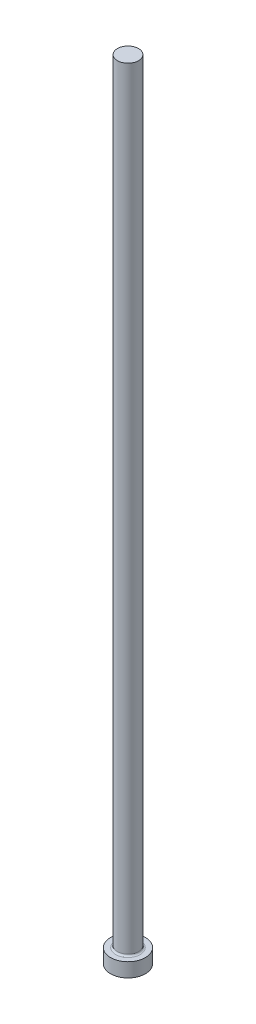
ISO-10303-21;
HEADER;
FILE_DESCRIPTION(('STEP AP214'),'2;1');
FILE_NAME('part.step','',(''),(''),'','','');
FILE_SCHEMA(('AUTOMOTIVE_DESIGN { 1 0 10303 214 1 1 1 1 }'));
ENDSEC;
DATA;
#1=APPLICATION_CONTEXT('core data for automotive mechanical design processes');
#2=APPLICATION_PROTOCOL_DEFINITION('international standard','automotive_design',2000,#1);
#3=PRODUCT_CONTEXT('',#1,'mechanical');
#4=PRODUCT('Part','Part','',(#3));
#5=PRODUCT_RELATED_PRODUCT_CATEGORY('part','',(#4));
#6=PRODUCT_DEFINITION_FORMATION('','',#4);
#7=PRODUCT_DEFINITION_CONTEXT('part definition',#1,'design');
#8=PRODUCT_DEFINITION('design','',#6,#7);
#9=PRODUCT_DEFINITION_SHAPE('','',#8);
#10=(LENGTH_UNIT() NAMED_UNIT(*) SI_UNIT(.MILLI.,.METRE.));
#11=(NAMED_UNIT(*) PLANE_ANGLE_UNIT() SI_UNIT($,.RADIAN.));
#12=(NAMED_UNIT(*) SI_UNIT($,.STERADIAN.) SOLID_ANGLE_UNIT());
#13=UNCERTAINTY_MEASURE_WITH_UNIT(LENGTH_MEASURE(1.E-05),#10,'distance_accuracy_value','');
#14=(GEOMETRIC_REPRESENTATION_CONTEXT(3) GLOBAL_UNCERTAINTY_ASSIGNED_CONTEXT((#13)) GLOBAL_UNIT_ASSIGNED_CONTEXT((#10,
#11,#12)) REPRESENTATION_CONTEXT('',''));
#15=CARTESIAN_POINT('',(0.,0.,0.));
#16=DIRECTION('',(0.,0.,1.));
#17=DIRECTION('',(1.,0.,0.));
#18=AXIS2_PLACEMENT_3D('',#15,#16,#17);
#19=CARTESIAN_POINT('',(4.76249999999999,355.6,0.));
#20=DIRECTION('',(0.,-1.,0.));
#21=DIRECTION('',(1.,0.,0.));
#22=AXIS2_PLACEMENT_3D('',#19,#20,#21);
#23=PLANE('',#22);
#24=CARTESIAN_POINT('',(0.,355.6,0.));
#25=DIRECTION('',(0.,1.,0.));
#26=DIRECTION('',(-1.,0.,0.));
#27=AXIS2_PLACEMENT_3D('',#24,#25,#26);
#28=CIRCLE('',#27,4.7625);
#29=CARTESIAN_POINT('',(-4.76250000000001,355.6,0.));
#30=VERTEX_POINT('',#29);
#31=EDGE_CURVE('E10',#30,#30,#28,.T.);
#32=ORIENTED_EDGE('',*,*,#31,.T.);
#33=EDGE_LOOP('',(#32));
#34=FACE_BOUND('',#33,.T.);
#35=ADVANCED_FACE('F30',(#34),#23,.F.);
#36=CARTESIAN_POINT('',(0.,355.6,0.));
#37=DIRECTION('',(0.,1.,0.));
#38=DIRECTION('',(-1.,0.,0.));
#39=AXIS2_PLACEMENT_3D('',#36,#37,#38);
#40=CYLINDRICAL_SURFACE('',#39,4.7625);
#41=ORIENTED_EDGE('',*,*,#31,.F.);
#42=EDGE_LOOP('',(#41));
#43=FACE_BOUND('',#42,.T.);
#44=CARTESIAN_POINT('',(0.,7.11200000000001,0.));
#45=DIRECTION('',(0.,1.,0.));
#46=DIRECTION('',(-1.,0.,0.));
#47=AXIS2_PLACEMENT_3D('',#44,#45,#46);
#48=CIRCLE('',#47,4.7625);
#49=CARTESIAN_POINT('',(-4.7625,7.11200000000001,0.));
#50=VERTEX_POINT('',#49);
#51=EDGE_CURVE('E36',#50,#50,#48,.T.);
#52=ORIENTED_EDGE('',*,*,#51,.T.);
#53=EDGE_LOOP('',(#52));
#54=FACE_BOUND('',#53,.T.);
#55=ADVANCED_FACE('F65',(#43,#54),#40,.T.);
#56=CARTESIAN_POINT('',(0.,7.112,0.));
#57=DIRECTION('',(0.,1.,0.));
#58=DIRECTION('',(-1.,0.,0.));
#59=AXIS2_PLACEMENT_3D('',#56,#57,#58);
#60=TOROIDAL_SURFACE('',#59,5.5245,0.762);
#61=ORIENTED_EDGE('',*,*,#51,.F.);
#62=EDGE_LOOP('',(#61));
#63=FACE_BOUND('',#62,.T.);
#64=CARTESIAN_POINT('',(0.,6.35000000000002,0.));
#65=DIRECTION('',(0.,1.,0.));
#66=DIRECTION('',(-1.,0.,0.));
#67=AXIS2_PLACEMENT_3D('',#64,#65,#66);
#68=CIRCLE('',#67,5.5245);
#69=CARTESIAN_POINT('',(-5.5245,6.35000000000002,0.));
#70=VERTEX_POINT('',#69);
#71=EDGE_CURVE('E40',#70,#70,#68,.T.);
#72=ORIENTED_EDGE('',*,*,#71,.T.);
#73=EDGE_LOOP('',(#72));
#74=FACE_BOUND('',#73,.T.);
#75=ADVANCED_FACE('F69',(#63,#74),#60,.F.);
#76=CARTESIAN_POINT('',(7.874,6.35,0.));
#77=DIRECTION('',(0.,-1.,0.));
#78=DIRECTION('',(1.,0.,0.));
#79=AXIS2_PLACEMENT_3D('',#76,#77,#78);
#80=PLANE('',#79);
#81=ORIENTED_EDGE('',*,*,#71,.F.);
#82=EDGE_LOOP('',(#81));
#83=FACE_BOUND('',#82,.T.);
#84=CARTESIAN_POINT('',(0.,6.35000000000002,0.));
#85=DIRECTION('',(0.,1.,0.));
#86=DIRECTION('',(-1.,0.,0.));
#87=AXIS2_PLACEMENT_3D('',#84,#85,#86);
#88=CIRCLE('',#87,7.874);
#89=CARTESIAN_POINT('',(-7.874,6.35000000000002,0.));
#90=VERTEX_POINT('',#89);
#91=EDGE_CURVE('E44',#90,#90,#88,.T.);
#92=ORIENTED_EDGE('',*,*,#91,.T.);
#93=EDGE_LOOP('',(#92));
#94=FACE_BOUND('',#93,.T.);
#95=ADVANCED_FACE('F61',(#83,#94),#80,.F.);
#96=CARTESIAN_POINT('',(0.,355.6,0.));
#97=DIRECTION('',(0.,1.,0.));
#98=DIRECTION('',(-1.,0.,0.));
#99=AXIS2_PLACEMENT_3D('',#96,#97,#98);
#100=CYLINDRICAL_SURFACE('',#99,7.874);
#101=ORIENTED_EDGE('',*,*,#91,.F.);
#102=EDGE_LOOP('',(#101));
#103=FACE_BOUND('',#102,.T.);
#104=CARTESIAN_POINT('',(0.,0.,0.));
#105=DIRECTION('',(0.,1.,0.));
#106=DIRECTION('',(-1.,0.,0.));
#107=AXIS2_PLACEMENT_3D('',#104,#105,#106);
#108=CIRCLE('',#107,7.874);
#109=CARTESIAN_POINT('',(-7.874,0.,0.));
#110=VERTEX_POINT('',#109);
#111=EDGE_CURVE('E49',#110,#110,#108,.T.);
#112=ORIENTED_EDGE('',*,*,#111,.T.);
#113=EDGE_LOOP('',(#112));
#114=FACE_BOUND('',#113,.T.);
#115=ADVANCED_FACE('F53',(#103,#114),#100,.T.);
#116=CARTESIAN_POINT('',(0.,0.,0.));
#117=DIRECTION('',(0.,1.,0.));
#118=DIRECTION('',(-1.,0.,0.));
#119=AXIS2_PLACEMENT_3D('',#116,#117,#118);
#120=PLANE('',#119);
#121=ORIENTED_EDGE('',*,*,#111,.F.);
#122=EDGE_LOOP('',(#121));
#123=FACE_BOUND('',#122,.T.);
#124=ADVANCED_FACE('F55',(#123),#120,.F.);
#125=CLOSED_SHELL('',(#35,#55,#75,#95,#115,#124));
#126=MANIFOLD_SOLID_BREP('B2',#125);
#127=ADVANCED_BREP_SHAPE_REPRESENTATION('',(#18,#126),#14);
#128=SHAPE_DEFINITION_REPRESENTATION(#9,#127);
ENDSEC;
END-ISO-10303-21;
